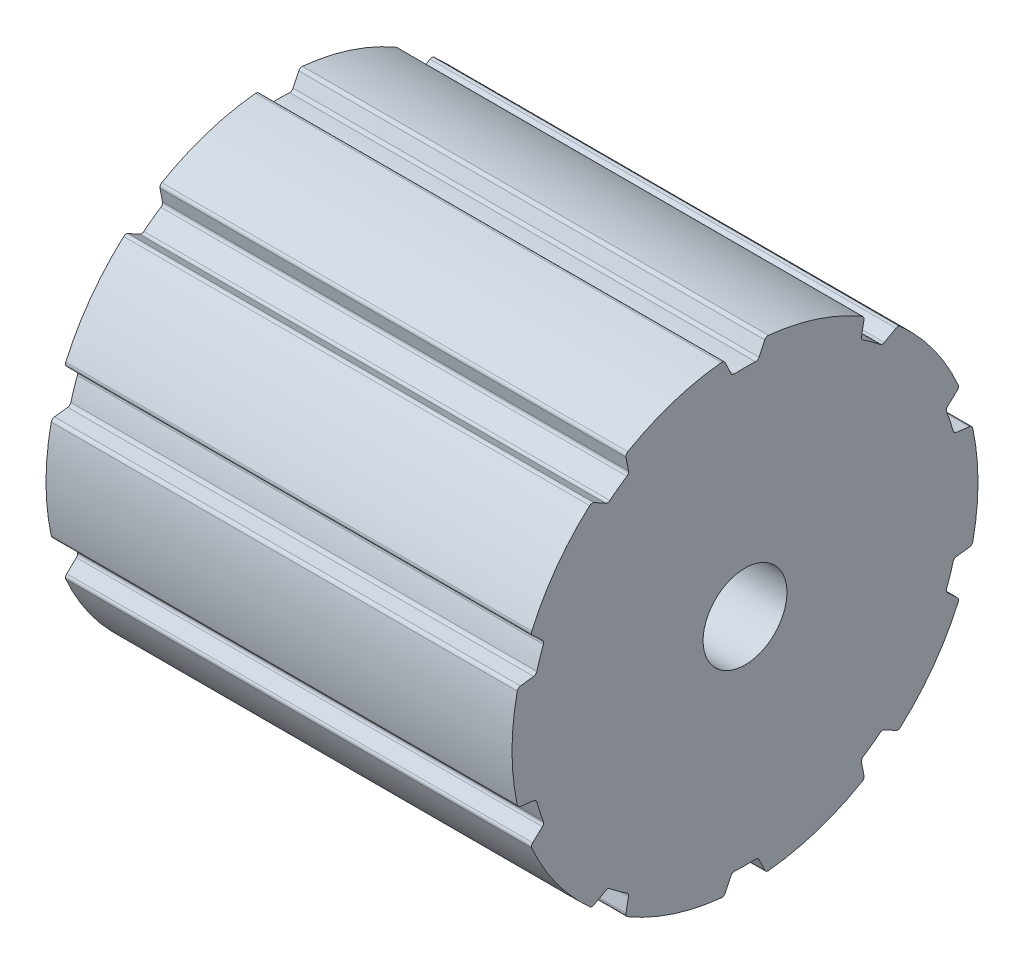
from build123d import *

# Parameters (mm, degrees)
CHAMFER_1_SIZE           = 1
SKETCH_4_W               = 2
SKETCH_4_H               = 1.208712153
CUT_EXTRUDE_1_DEPTH      = 62.23724357
CUT_EXTRUDE_2_REACH      = 63.237
PATTERN_CIRCULAR_3_COUNT = 10


with BuildPart() as part:
    # Sketch 1 → Revolve 1 (revolve)
    with BuildSketch(Plane.XY, mode=Mode.PRIVATE) as revolve_1_sk:
        Polygon((0, 2.5), (0, 25), (50, 25), (50, 4.5), (20, 4.5), (20, 2.5), align=None)
    revolve(revolve_1_sk.sketch.rotate(Axis((0, 0, 0), (1, 0, 0)), 90), axis=Axis((0, 0, 0), (1, 0, 0)))

    # Chamfer 1
    chamfer_1_edges = [part.edges().sort_by_distance(p)[0] for p in [
        (20, 0, -2.5),
        (0, 0, -2.5),
    ]]
    chamfer(chamfer_1_edges, length=CHAMFER_1_SIZE)

    # Sketch 4 → Cut-Extrude 1 (cut, through all)
    with BuildSketch(Plane.ZY):
        with Locations((0, 2.895643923)):
            Rectangle(SKETCH_4_W, SKETCH_4_H)
    extrude(amount=-CUT_EXTRUDE_1_DEPTH, mode=Mode.SUBTRACT)

    # Sketch 6 → Cut-Extrude 2 (cut, up to next)
    with BuildSketch(Plane(origin=(0, 0, 0), x_dir=(0, 0, -1), z_dir=(1, 0, 0)), mode=Mode.PRIVATE) as cut_extrude_2_sk1:
        with BuildLine():
            Line((2.119939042, 24.643470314), (1.514313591, 23.344702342))
            ThreePointArc((1.514313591, 23.344702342), (1.358390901, 23.171235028), (1.13222046, 23.114228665))
            ThreePointArc((1.13222046, 23.114228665), (0, 23.141942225), (-1.13222046, 23.114228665))
            ThreePointArc((-1.13222046, 23.114228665), (-1.358390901, 23.171235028), (-1.514313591, 23.344702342))
            Line((-1.514313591, 23.344702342), (-2.119939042, 24.643470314))
            ThreePointArc((-2.119939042, 24.643470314), (-2.284860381, 24.822206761), (-2.522827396, 24.872381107))
            ThreePointArc((-2.522827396, 24.872381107), (-2.721725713, 24.851402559), (-2.920449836, 24.828833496))
            Line((-2.920449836, 24.828833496), (-3.535923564, 26.148721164))
            ThreePointArc((-3.535923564, 26.148721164), (0, 26.386708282), (3.535923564, 26.148721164))
            Line((3.535923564, 26.148721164), (2.920449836, 24.828833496))
            ThreePointArc((2.920449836, 24.828833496), (2.721725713, 24.851402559), (2.522827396, 24.872381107))
            ThreePointArc((2.522827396, 24.872381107), (2.284860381, 24.822206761), (2.119939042, 24.643470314))
        make_face()
    cut_extrude_2_tool1 = extrude(cut_extrude_2_sk1.sketch, amount=CUT_EXTRUDE_2_REACH, mode=Mode.PRIVATE) & part.part
    cut_extrude_2 = cut_extrude_2_tool1.solids().sort_by_distance((0, 24.992577, 0))[0]
    add(cut_extrude_2, mode=Mode.SUBTRACT)

    # Pattern Circular 3: Cut-Extrude 2 ×10 about axis
    pattern_circular_3_axis = Axis((0, 0, 0), (1, 0, 0))
    for i in range(1, PATTERN_CIRCULAR_3_COUNT):
        add(cut_extrude_2.rotate(pattern_circular_3_axis, i * 360 / PATTERN_CIRCULAR_3_COUNT), mode=Mode.SUBTRACT)


solid = part.part
